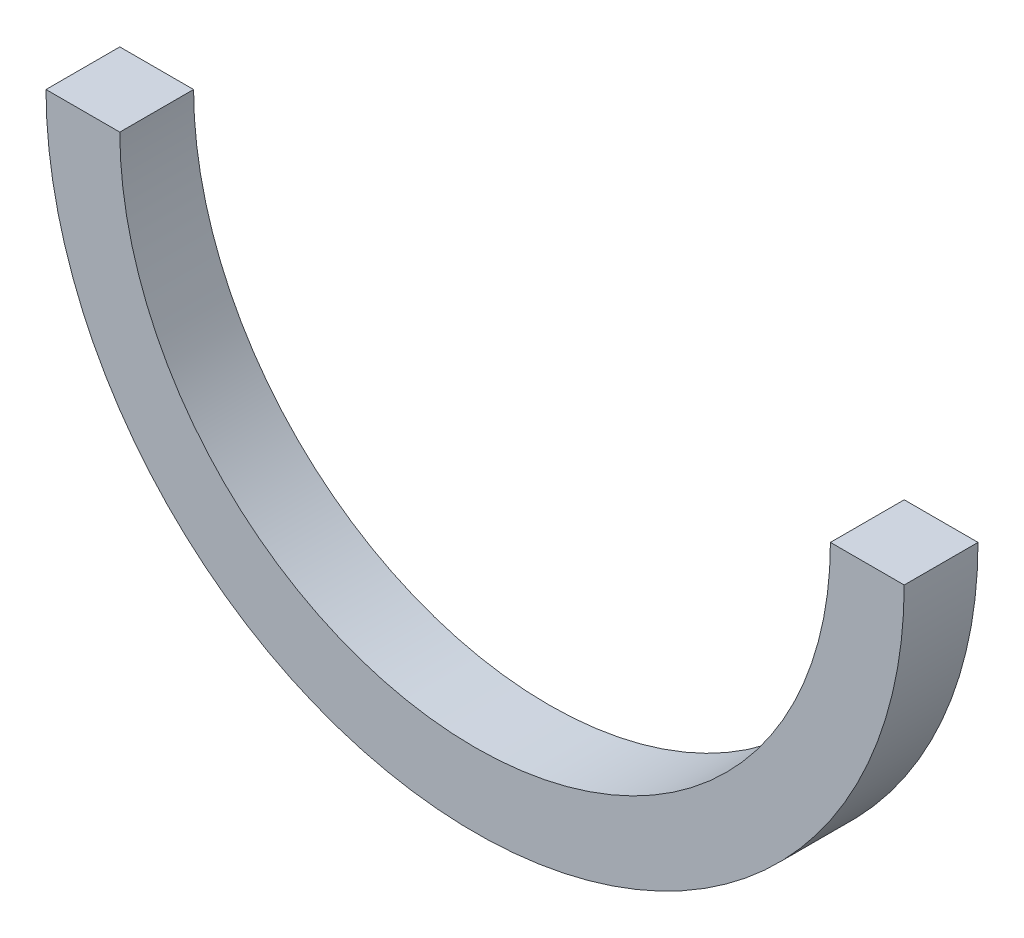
ISO-10303-21;
HEADER;
FILE_DESCRIPTION(('STEP AP214'),'2;1');
FILE_NAME('part.step','',(''),(''),'','','');
FILE_SCHEMA(('AUTOMOTIVE_DESIGN { 1 0 10303 214 1 1 1 1 }'));
ENDSEC;
DATA;
#1=APPLICATION_CONTEXT('core data for automotive mechanical design processes');
#2=APPLICATION_PROTOCOL_DEFINITION('international standard','automotive_design',2000,#1);
#3=PRODUCT_CONTEXT('',#1,'mechanical');
#4=PRODUCT('Part','Part','',(#3));
#5=PRODUCT_RELATED_PRODUCT_CATEGORY('part','',(#4));
#6=PRODUCT_DEFINITION_FORMATION('','',#4);
#7=PRODUCT_DEFINITION_CONTEXT('part definition',#1,'design');
#8=PRODUCT_DEFINITION('design','',#6,#7);
#9=PRODUCT_DEFINITION_SHAPE('','',#8);
#10=(LENGTH_UNIT() NAMED_UNIT(*) SI_UNIT(.MILLI.,.METRE.));
#11=(NAMED_UNIT(*) PLANE_ANGLE_UNIT() SI_UNIT($,.RADIAN.));
#12=(NAMED_UNIT(*) SI_UNIT($,.STERADIAN.) SOLID_ANGLE_UNIT());
#13=UNCERTAINTY_MEASURE_WITH_UNIT(LENGTH_MEASURE(1.E-05),#10,'distance_accuracy_value','');
#14=(GEOMETRIC_REPRESENTATION_CONTEXT(3) GLOBAL_UNCERTAINTY_ASSIGNED_CONTEXT((#13)) GLOBAL_UNIT_ASSIGNED_CONTEXT((#10,
#11,#12)) REPRESENTATION_CONTEXT('',''));
#15=CARTESIAN_POINT('',(0.,0.,0.));
#16=DIRECTION('',(0.,0.,1.));
#17=DIRECTION('',(1.,0.,0.));
#18=AXIS2_PLACEMENT_3D('',#15,#16,#17);
#19=CARTESIAN_POINT('',(0.,0.,0.));
#20=DIRECTION('',(0.,1.,0.));
#21=DIRECTION('',(0.,0.,-1.));
#22=AXIS2_PLACEMENT_3D('',#19,#20,#21);
#23=PLANE('',#22);
#24=DIRECTION('',(0.,0.,-1.));
#25=VECTOR('',#24,1.);
#26=CARTESIAN_POINT('',(87.875,0.,9.125));
#27=LINE('',#26,#25);
#28=CARTESIAN_POINT('',(87.875,0.,9.125));
#29=VERTEX_POINT('',#28);
#30=CARTESIAN_POINT('',(87.875,0.,-9.125));
#31=VERTEX_POINT('',#30);
#32=EDGE_CURVE('E75',#29,#31,#27,.T.);
#33=ORIENTED_EDGE('',*,*,#32,.F.);
#34=DIRECTION('',(-1.,0.,0.));
#35=VECTOR('',#34,1.);
#36=CARTESIAN_POINT('',(106.125,0.,9.125));
#37=LINE('',#36,#35);
#38=CARTESIAN_POINT('',(106.125,0.,9.125));
#39=VERTEX_POINT('',#38);
#40=EDGE_CURVE('E63',#39,#29,#37,.T.);
#41=ORIENTED_EDGE('',*,*,#40,.F.);
#42=DIRECTION('',(0.,0.,1.));
#43=VECTOR('',#42,1.);
#44=CARTESIAN_POINT('',(106.125,0.,9.125));
#45=LINE('',#44,#43);
#46=CARTESIAN_POINT('',(106.125,0.,-9.125));
#47=VERTEX_POINT('',#46);
#48=EDGE_CURVE('E68',#47,#39,#45,.T.);
#49=ORIENTED_EDGE('',*,*,#48,.F.);
#50=DIRECTION('',(1.,0.,0.));
#51=VECTOR('',#50,1.);
#52=CARTESIAN_POINT('',(106.125,0.,-9.125));
#53=LINE('',#52,#51);
#54=EDGE_CURVE('E72',#31,#47,#53,.T.);
#55=ORIENTED_EDGE('',*,*,#54,.F.);
#56=EDGE_LOOP('',(#33,#41,#49,#55));
#57=FACE_BOUND('',#56,.T.);
#58=ADVANCED_FACE('F33',(#57),#23,.T.);
#59=CARTESIAN_POINT('',(0.,0.,0.));
#60=DIRECTION('',(0.,-1.,0.));
#61=DIRECTION('',(0.,0.,-1.));
#62=AXIS2_PLACEMENT_3D('',#59,#60,#61);
#63=PLANE('',#62);
#64=DIRECTION('',(0.,0.,-1.));
#65=VECTOR('',#64,1.);
#66=CARTESIAN_POINT('',(-87.875,0.,9.125));
#67=LINE('',#66,#65);
#68=CARTESIAN_POINT('',(-87.875,0.,9.125));
#69=VERTEX_POINT('',#68);
#70=CARTESIAN_POINT('',(-87.875,0.,-9.125));
#71=VERTEX_POINT('',#70);
#72=EDGE_CURVE('E89',#69,#71,#67,.T.);
#73=ORIENTED_EDGE('',*,*,#72,.T.);
#74=DIRECTION('',(-1.,0.,0.));
#75=VECTOR('',#74,1.);
#76=CARTESIAN_POINT('',(-106.125,0.,-9.125));
#77=LINE('',#76,#75);
#78=CARTESIAN_POINT('',(-106.125,0.,-9.125));
#79=VERTEX_POINT('',#78);
#80=EDGE_CURVE('E52',#71,#79,#77,.T.);
#81=ORIENTED_EDGE('',*,*,#80,.T.);
#82=DIRECTION('',(0.,0.,1.));
#83=VECTOR('',#82,1.);
#84=CARTESIAN_POINT('',(-106.125,0.,9.125));
#85=LINE('',#84,#83);
#86=CARTESIAN_POINT('',(-106.125,0.,9.125));
#87=VERTEX_POINT('',#86);
#88=EDGE_CURVE('E46',#79,#87,#85,.T.);
#89=ORIENTED_EDGE('',*,*,#88,.T.);
#90=DIRECTION('',(1.,0.,0.));
#91=VECTOR('',#90,1.);
#92=CARTESIAN_POINT('',(-106.125,0.,9.125));
#93=LINE('',#92,#91);
#94=EDGE_CURVE('E11',#87,#69,#93,.T.);
#95=ORIENTED_EDGE('',*,*,#94,.T.);
#96=EDGE_LOOP('',(#73,#81,#89,#95));
#97=FACE_BOUND('',#96,.T.);
#98=ADVANCED_FACE('F114',(#97),#63,.F.);
#99=CARTESIAN_POINT('',(0.,0.,0.));
#100=DIRECTION('',(0.,0.,-1.));
#101=DIRECTION('',(-1.,0.,0.));
#102=AXIS2_PLACEMENT_3D('',#99,#100,#101);
#103=CYLINDRICAL_SURFACE('',#102,87.875);
#104=CARTESIAN_POINT('',(0.,0.,-9.125));
#105=DIRECTION('',(0.,0.,-1.));
#106=DIRECTION('',(1.,0.,0.));
#107=AXIS2_PLACEMENT_3D('',#104,#105,#106);
#108=CIRCLE('',#107,87.875);
#109=EDGE_CURVE('E91',#31,#71,#108,.T.);
#110=ORIENTED_EDGE('',*,*,#109,.T.);
#111=ORIENTED_EDGE('',*,*,#72,.F.);
#112=CARTESIAN_POINT('',(0.,0.,9.125));
#113=DIRECTION('',(0.,0.,-1.));
#114=DIRECTION('',(1.,0.,0.));
#115=AXIS2_PLACEMENT_3D('',#112,#113,#114);
#116=CIRCLE('',#115,87.875);
#117=EDGE_CURVE('E85',#29,#69,#116,.T.);
#118=ORIENTED_EDGE('',*,*,#117,.F.);
#119=ORIENTED_EDGE('',*,*,#32,.T.);
#120=EDGE_LOOP('',(#110,#111,#118,#119));
#121=FACE_BOUND('',#120,.T.);
#122=ADVANCED_FACE('F88',(#121),#103,.F.);
#123=CARTESIAN_POINT('',(106.125,0.,-9.125));
#124=DIRECTION('',(0.,0.,-1.));
#125=DIRECTION('',(-1.,0.,0.));
#126=AXIS2_PLACEMENT_3D('',#123,#124,#125);
#127=PLANE('',#126);
#128=CARTESIAN_POINT('',(0.,0.,-9.125));
#129=DIRECTION('',(0.,0.,-1.));
#130=DIRECTION('',(1.,0.,0.));
#131=AXIS2_PLACEMENT_3D('',#128,#129,#130);
#132=CIRCLE('',#131,106.125);
#133=EDGE_CURVE('E97',#47,#79,#132,.T.);
#134=ORIENTED_EDGE('',*,*,#133,.T.);
#135=ORIENTED_EDGE('',*,*,#80,.F.);
#136=ORIENTED_EDGE('',*,*,#109,.F.);
#137=ORIENTED_EDGE('',*,*,#54,.T.);
#138=EDGE_LOOP('',(#134,#135,#136,#137));
#139=FACE_BOUND('',#138,.T.);
#140=ADVANCED_FACE('F106',(#139),#127,.T.);
#141=CARTESIAN_POINT('',(0.,0.,0.));
#142=DIRECTION('',(0.,0.,-1.));
#143=DIRECTION('',(-1.,0.,0.));
#144=AXIS2_PLACEMENT_3D('',#141,#142,#143);
#145=CYLINDRICAL_SURFACE('',#144,106.125);
#146=CARTESIAN_POINT('',(0.,0.,9.125));
#147=DIRECTION('',(0.,0.,-1.));
#148=DIRECTION('',(1.,0.,0.));
#149=AXIS2_PLACEMENT_3D('',#146,#147,#148);
#150=CIRCLE('',#149,106.125);
#151=EDGE_CURVE('E40',#39,#87,#150,.T.);
#152=ORIENTED_EDGE('',*,*,#151,.T.);
#153=ORIENTED_EDGE('',*,*,#88,.F.);
#154=ORIENTED_EDGE('',*,*,#133,.F.);
#155=ORIENTED_EDGE('',*,*,#48,.T.);
#156=EDGE_LOOP('',(#152,#153,#154,#155));
#157=FACE_BOUND('',#156,.T.);
#158=ADVANCED_FACE('F103',(#157),#145,.T.);
#159=CARTESIAN_POINT('',(106.125,0.,9.125));
#160=DIRECTION('',(0.,0.,1.));
#161=DIRECTION('',(1.,0.,0.));
#162=AXIS2_PLACEMENT_3D('',#159,#160,#161);
#163=PLANE('',#162);
#164=ORIENTED_EDGE('',*,*,#94,.F.);
#165=ORIENTED_EDGE('',*,*,#151,.F.);
#166=ORIENTED_EDGE('',*,*,#40,.T.);
#167=ORIENTED_EDGE('',*,*,#117,.T.);
#168=EDGE_LOOP('',(#164,#165,#166,#167));
#169=FACE_BOUND('',#168,.T.);
#170=ADVANCED_FACE('F84',(#169),#163,.T.);
#171=CLOSED_SHELL('',(#58,#98,#122,#140,#158,#170));
#172=MANIFOLD_SOLID_BREP('B2',#171);
#173=ADVANCED_BREP_SHAPE_REPRESENTATION('',(#18,#172),#14);
#174=SHAPE_DEFINITION_REPRESENTATION(#9,#173);
ENDSEC;
END-ISO-10303-21;
